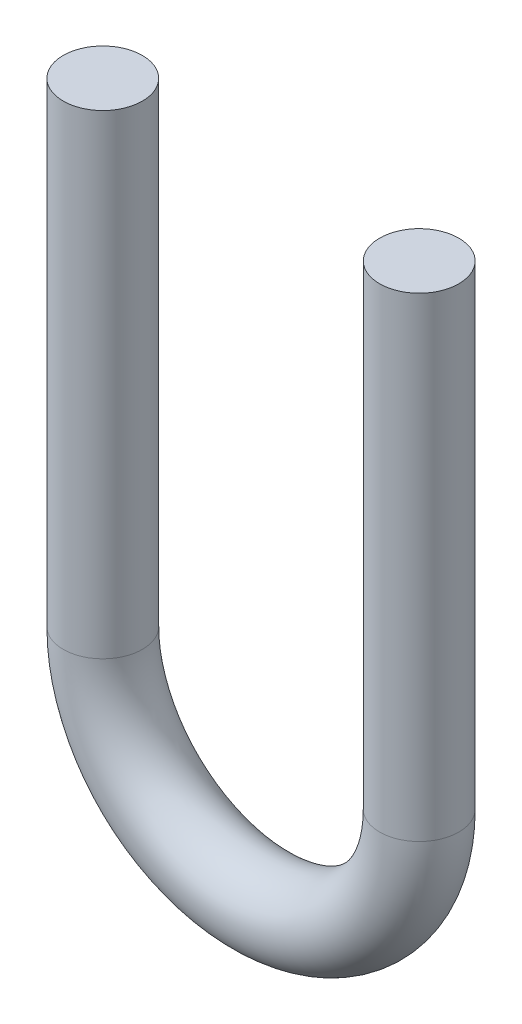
ISO-10303-21;
HEADER;
FILE_DESCRIPTION(('STEP AP214'),'2;1');
FILE_NAME('part.step','',(''),(''),'','','');
FILE_SCHEMA(('AUTOMOTIVE_DESIGN { 1 0 10303 214 1 1 1 1 }'));
ENDSEC;
DATA;
#1=APPLICATION_CONTEXT('core data for automotive mechanical design processes');
#2=APPLICATION_PROTOCOL_DEFINITION('international standard','automotive_design',2000,#1);
#3=PRODUCT_CONTEXT('',#1,'mechanical');
#4=PRODUCT('Part','Part','',(#3));
#5=PRODUCT_RELATED_PRODUCT_CATEGORY('part','',(#4));
#6=PRODUCT_DEFINITION_FORMATION('','',#4);
#7=PRODUCT_DEFINITION_CONTEXT('part definition',#1,'design');
#8=PRODUCT_DEFINITION('design','',#6,#7);
#9=PRODUCT_DEFINITION_SHAPE('','',#8);
#10=(LENGTH_UNIT() NAMED_UNIT(*) SI_UNIT(.MILLI.,.METRE.));
#11=(NAMED_UNIT(*) PLANE_ANGLE_UNIT() SI_UNIT($,.RADIAN.));
#12=(NAMED_UNIT(*) SI_UNIT($,.STERADIAN.) SOLID_ANGLE_UNIT());
#13=UNCERTAINTY_MEASURE_WITH_UNIT(LENGTH_MEASURE(1.E-05),#10,'distance_accuracy_value','');
#14=(GEOMETRIC_REPRESENTATION_CONTEXT(3) GLOBAL_UNCERTAINTY_ASSIGNED_CONTEXT((#13)) GLOBAL_UNIT_ASSIGNED_CONTEXT((#10,
#11,#12)) REPRESENTATION_CONTEXT('',''));
#15=CARTESIAN_POINT('',(0.,0.,0.));
#16=DIRECTION('',(0.,0.,1.));
#17=DIRECTION('',(1.,0.,0.));
#18=AXIS2_PLACEMENT_3D('',#15,#16,#17);
#19=CARTESIAN_POINT('',(-26.097954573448,-9.25185707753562,0.));
#20=DIRECTION('',(0.,1.,0.));
#21=DIRECTION('',(-1.,0.,0.));
#22=AXIS2_PLACEMENT_3D('',#19,#20,#21);
#23=CYLINDRICAL_SURFACE('',#22,0.79375);
#24=CARTESIAN_POINT('',(-26.097954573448,-9.25185707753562,0.));
#25=DIRECTION('',(0.,1.,0.));
#26=DIRECTION('',(0.,0.,-1.));
#27=AXIS2_PLACEMENT_3D('',#24,#25,#26);
#28=CIRCLE('',#27,0.79375);
#29=CARTESIAN_POINT('',(-25.304204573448,-9.25185707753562,0.));
#30=VERTEX_POINT('',#29);
#31=EDGE_CURVE('E34',#30,#30,#28,.T.);
#32=ORIENTED_EDGE('',*,*,#31,.T.);
#33=EDGE_LOOP('',(#32));
#34=FACE_BOUND('',#33,.T.);
#35=CARTESIAN_POINT('',(-26.097954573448,0.273142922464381,0.));
#36=DIRECTION('',(0.,1.,0.));
#37=DIRECTION('',(0.,0.,-1.));
#38=AXIS2_PLACEMENT_3D('',#35,#36,#37);
#39=CIRCLE('',#38,0.79375);
#40=CARTESIAN_POINT('',(-26.097954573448,0.273142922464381,-0.79375));
#41=VERTEX_POINT('',#40);
#42=EDGE_CURVE('E10',#41,#41,#39,.T.);
#43=ORIENTED_EDGE('',*,*,#42,.F.);
#44=EDGE_LOOP('',(#43));
#45=FACE_BOUND('',#44,.T.);
#46=ADVANCED_FACE('F28',(#34,#45),#23,.T.);
#47=CARTESIAN_POINT('',(-29.2716536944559,-9.25185707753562,0.));
#48=DIRECTION('',(0.,0.,1.));
#49=DIRECTION('',(1.,0.,0.));
#50=AXIS2_PLACEMENT_3D('',#47,#48,#49);
#51=TOROIDAL_SURFACE('',#50,3.17369912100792,0.79375);
#52=CARTESIAN_POINT('',(-32.4453528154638,-9.25185707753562,0.));
#53=DIRECTION('',(0.,-1.,0.));
#54=DIRECTION('',(0.,0.,-1.));
#55=AXIS2_PLACEMENT_3D('',#52,#53,#54);
#56=CIRCLE('',#55,0.79375);
#57=CARTESIAN_POINT('',(-33.2391028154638,-9.25185707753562,0.));
#58=VERTEX_POINT('',#57);
#59=EDGE_CURVE('E38',#58,#58,#56,.T.);
#60=CARTESIAN_POINT('',(-29.2716536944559,-9.25185707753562,0.));
#61=DIRECTION('',(0.,0.,1.));
#62=DIRECTION('',(1.,0.,0.));
#63=AXIS2_PLACEMENT_3D('',#60,#61,#62);
#64=CIRCLE('',#63,3.96744912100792);
#65=EDGE_CURVE('',#58,#30,#64,.T.);
#66=ORIENTED_EDGE('',*,*,#59,.T.);
#67=ORIENTED_EDGE('',*,*,#31,.F.);
#68=ORIENTED_EDGE('',*,*,#65,.T.);
#69=ORIENTED_EDGE('',*,*,#65,.F.);
#70=EDGE_LOOP('',(#66,#68,#67,#69));
#71=FACE_BOUND('',#70,.T.);
#72=ADVANCED_FACE('F60',(#71),#51,.T.);
#73=CARTESIAN_POINT('',(-32.4453528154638,-9.25185707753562,0.));
#74=DIRECTION('',(0.,1.,0.));
#75=DIRECTION('',(0.,0.,1.));
#76=AXIS2_PLACEMENT_3D('',#73,#74,#75);
#77=CYLINDRICAL_SURFACE('',#76,0.79375);
#78=ORIENTED_EDGE('',*,*,#59,.F.);
#79=EDGE_LOOP('',(#78));
#80=FACE_BOUND('',#79,.T.);
#81=CARTESIAN_POINT('',(-32.4453528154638,0.27314292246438,0.));
#82=DIRECTION('',(0.,-1.,0.));
#83=DIRECTION('',(0.,0.,-1.));
#84=AXIS2_PLACEMENT_3D('',#81,#82,#83);
#85=CIRCLE('',#84,0.79375);
#86=CARTESIAN_POINT('',(-32.4453528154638,0.27314292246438,-0.79375));
#87=VERTEX_POINT('',#86);
#88=EDGE_CURVE('E42',#87,#87,#85,.T.);
#89=ORIENTED_EDGE('',*,*,#88,.T.);
#90=EDGE_LOOP('',(#89));
#91=FACE_BOUND('',#90,.T.);
#92=ADVANCED_FACE('F48',(#80,#91),#77,.T.);
#93=CARTESIAN_POINT('',(-26.097954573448,0.273142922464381,0.));
#94=DIRECTION('',(0.,1.,0.));
#95=DIRECTION('',(0.,0.,-1.));
#96=AXIS2_PLACEMENT_3D('',#93,#94,#95);
#97=PLANE('',#96);
#98=ORIENTED_EDGE('',*,*,#42,.T.);
#99=EDGE_LOOP('',(#98));
#100=FACE_BOUND('',#99,.T.);
#101=ADVANCED_FACE('F52',(#100),#97,.T.);
#102=CARTESIAN_POINT('',(-32.4453528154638,0.27314292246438,0.));
#103=DIRECTION('',(0.,-1.,0.));
#104=DIRECTION('',(0.,0.,-1.));
#105=AXIS2_PLACEMENT_3D('',#102,#103,#104);
#106=PLANE('',#105);
#107=ORIENTED_EDGE('',*,*,#88,.F.);
#108=EDGE_LOOP('',(#107));
#109=FACE_BOUND('',#108,.T.);
#110=ADVANCED_FACE('F50',(#109),#106,.F.);
#111=CLOSED_SHELL('',(#46,#72,#92,#101,#110));
#112=MANIFOLD_SOLID_BREP('B2',#111);
#113=ADVANCED_BREP_SHAPE_REPRESENTATION('',(#18,#112),#14);
#114=SHAPE_DEFINITION_REPRESENTATION(#9,#113);
ENDSEC;
END-ISO-10303-21;
